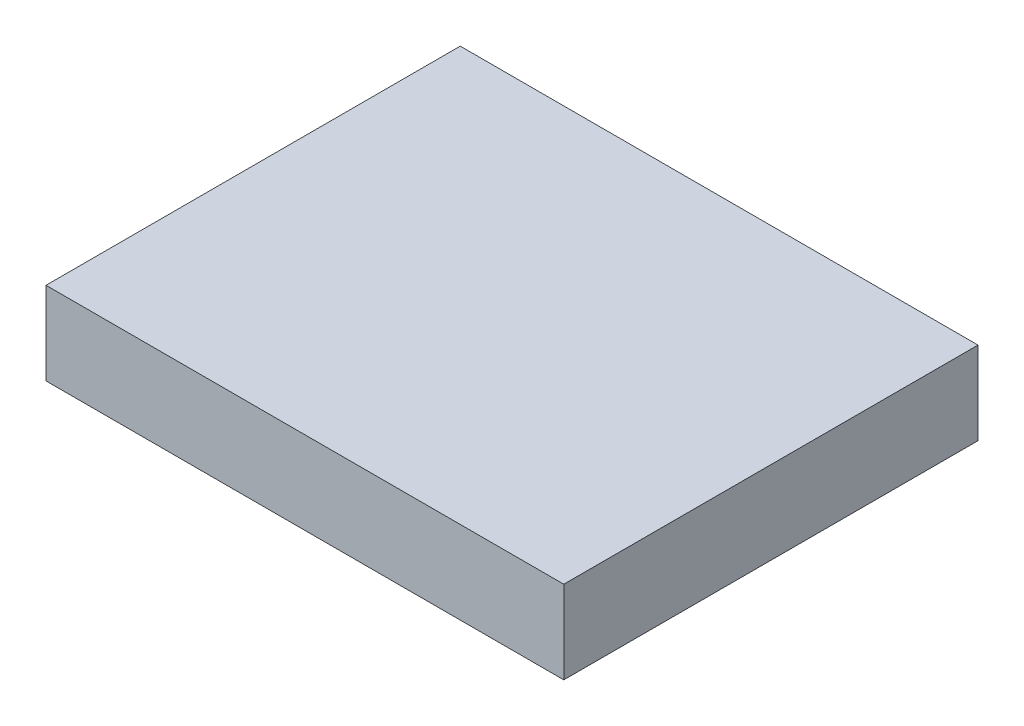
from build123d import *

# Parameters (mm, degrees)
ESQUISSE1_W      = 50
ESQUISSE1_H      = 40
EXTRUSION1_DEPTH = 8


with BuildPart() as part:
    # Esquisse1 → Extrusion1 (new body)
    with BuildSketch(Plane(origin=(0, 0, 0), x_dir=(1, 0, 0), z_dir=(0, 1, 0))):
        with Locations((25, 20)):
            Rectangle(ESQUISSE1_W, ESQUISSE1_H)
    extrude(amount=EXTRUSION1_DEPTH)


solid = part.part
